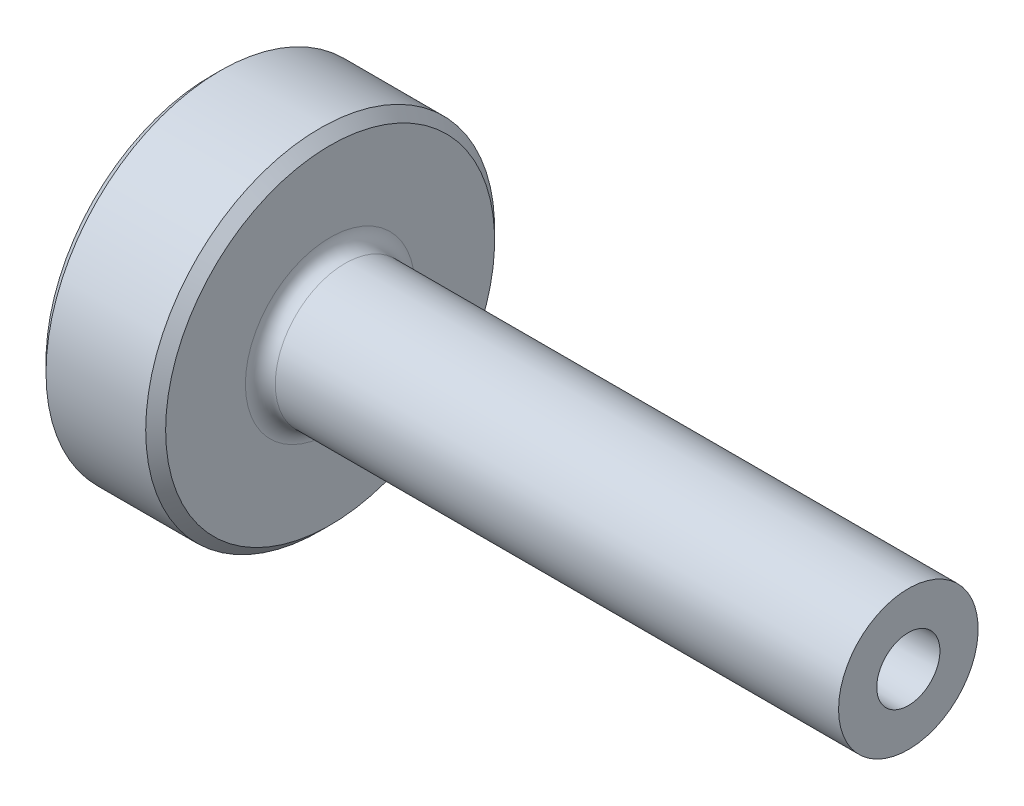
ISO-10303-21;
HEADER;
FILE_DESCRIPTION(('STEP AP214'),'2;1');
FILE_NAME('part.step','',(''),(''),'','','');
FILE_SCHEMA(('AUTOMOTIVE_DESIGN { 1 0 10303 214 1 1 1 1 }'));
ENDSEC;
DATA;
#1=APPLICATION_CONTEXT('core data for automotive mechanical design processes');
#2=APPLICATION_PROTOCOL_DEFINITION('international standard','automotive_design',2000,#1);
#3=PRODUCT_CONTEXT('',#1,'mechanical');
#4=PRODUCT('Part','Part','',(#3));
#5=PRODUCT_RELATED_PRODUCT_CATEGORY('part','',(#4));
#6=PRODUCT_DEFINITION_FORMATION('','',#4);
#7=PRODUCT_DEFINITION_CONTEXT('part definition',#1,'design');
#8=PRODUCT_DEFINITION('design','',#6,#7);
#9=PRODUCT_DEFINITION_SHAPE('','',#8);
#10=(LENGTH_UNIT() NAMED_UNIT(*) SI_UNIT(.MILLI.,.METRE.));
#11=(NAMED_UNIT(*) PLANE_ANGLE_UNIT() SI_UNIT($,.RADIAN.));
#12=(NAMED_UNIT(*) SI_UNIT($,.STERADIAN.) SOLID_ANGLE_UNIT());
#13=UNCERTAINTY_MEASURE_WITH_UNIT(LENGTH_MEASURE(1.E-05),#10,'distance_accuracy_value','');
#14=(GEOMETRIC_REPRESENTATION_CONTEXT(3) GLOBAL_UNCERTAINTY_ASSIGNED_CONTEXT((#13)) GLOBAL_UNIT_ASSIGNED_CONTEXT((#10,
#11,#12)) REPRESENTATION_CONTEXT('',''));
#15=CARTESIAN_POINT('',(0.,0.,0.));
#16=DIRECTION('',(0.,0.,1.));
#17=DIRECTION('',(1.,0.,0.));
#18=AXIS2_PLACEMENT_3D('',#15,#16,#17);
#19=CARTESIAN_POINT('',(0.,0.,0.));
#20=DIRECTION('',(-1.,0.,0.));
#21=DIRECTION('',(0.,0.,1.));
#22=AXIS2_PLACEMENT_3D('',#19,#20,#21);
#23=CYLINDRICAL_SURFACE('',#22,17.5);
#24=CARTESIAN_POINT('',(0.999999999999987,0.,0.));
#25=DIRECTION('',(1.,0.,0.));
#26=DIRECTION('',(0.,0.,-1.));
#27=AXIS2_PLACEMENT_3D('',#24,#25,#26);
#28=CIRCLE('',#27,17.5);
#29=CARTESIAN_POINT('',(0.999999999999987,0.,-17.5));
#30=VERTEX_POINT('',#29);
#31=EDGE_CURVE('E9',#30,#30,#28,.T.);
#32=ORIENTED_EDGE('',*,*,#31,.T.);
#33=EDGE_LOOP('',(#32));
#34=FACE_BOUND('',#33,.T.);
#35=CARTESIAN_POINT('',(11.,0.,0.));
#36=DIRECTION('',(-1.,0.,0.));
#37=DIRECTION('',(0.,0.,1.));
#38=AXIS2_PLACEMENT_3D('',#35,#36,#37);
#39=CIRCLE('',#38,17.5);
#40=CARTESIAN_POINT('',(11.,0.,17.5));
#41=VERTEX_POINT('',#40);
#42=EDGE_CURVE('E29',#41,#41,#39,.T.);
#43=ORIENTED_EDGE('',*,*,#42,.T.);
#44=EDGE_LOOP('',(#43));
#45=FACE_BOUND('',#44,.T.);
#46=ADVANCED_FACE('F14',(#34,#45),#23,.T.);
#47=CARTESIAN_POINT('',(12.,17.5,0.));
#48=DIRECTION('',(-1.,0.,0.));
#49=DIRECTION('',(0.,0.,1.));
#50=AXIS2_PLACEMENT_3D('',#47,#48,#49);
#51=PLANE('',#50);
#52=CARTESIAN_POINT('',(12.,0.,0.));
#53=DIRECTION('',(-1.,0.,0.));
#54=DIRECTION('',(0.,0.,1.));
#55=AXIS2_PLACEMENT_3D('',#52,#53,#54);
#56=CIRCLE('',#55,16.5);
#57=CARTESIAN_POINT('',(12.,0.,16.5));
#58=VERTEX_POINT('',#57);
#59=EDGE_CURVE('E25',#58,#58,#56,.F.);
#60=ORIENTED_EDGE('',*,*,#59,.T.);
#61=EDGE_LOOP('',(#60));
#62=FACE_BOUND('',#61,.T.);
#63=CARTESIAN_POINT('',(12.,0.,0.));
#64=DIRECTION('',(-1.,0.,0.));
#65=DIRECTION('',(0.,0.,1.));
#66=AXIS2_PLACEMENT_3D('',#63,#64,#65);
#67=CIRCLE('',#66,8.5);
#68=CARTESIAN_POINT('',(12.,0.,8.5));
#69=VERTEX_POINT('',#68);
#70=EDGE_CURVE('E34',#69,#69,#67,.T.);
#71=ORIENTED_EDGE('',*,*,#70,.T.);
#72=EDGE_LOOP('',(#71));
#73=FACE_BOUND('',#72,.T.);
#74=ADVANCED_FACE('F70',(#62,#73),#51,.F.);
#75=CARTESIAN_POINT('',(13.5,0.,0.));
#76=DIRECTION('',(-1.,0.,0.));
#77=DIRECTION('',(0.,0.,1.));
#78=AXIS2_PLACEMENT_3D('',#75,#76,#77);
#79=TOROIDAL_SURFACE('',#78,8.5,1.5);
#80=ORIENTED_EDGE('',*,*,#70,.F.);
#81=EDGE_LOOP('',(#80));
#82=FACE_BOUND('',#81,.T.);
#83=CARTESIAN_POINT('',(13.5,0.,0.));
#84=DIRECTION('',(-1.,0.,0.));
#85=DIRECTION('',(0.,0.,1.));
#86=AXIS2_PLACEMENT_3D('',#83,#84,#85);
#87=CIRCLE('',#86,7.);
#88=CARTESIAN_POINT('',(13.5,0.,7.));
#89=VERTEX_POINT('',#88);
#90=EDGE_CURVE('E37',#89,#89,#87,.T.);
#91=ORIENTED_EDGE('',*,*,#90,.T.);
#92=EDGE_LOOP('',(#91));
#93=FACE_BOUND('',#92,.T.);
#94=ADVANCED_FACE('F76',(#82,#93),#79,.F.);
#95=CARTESIAN_POINT('',(0.,0.,0.));
#96=DIRECTION('',(-1.,0.,0.));
#97=DIRECTION('',(0.,0.,1.));
#98=AXIS2_PLACEMENT_3D('',#95,#96,#97);
#99=CYLINDRICAL_SURFACE('',#98,7.);
#100=ORIENTED_EDGE('',*,*,#90,.F.);
#101=EDGE_LOOP('',(#100));
#102=FACE_BOUND('',#101,.T.);
#103=CARTESIAN_POINT('',(70.,0.,0.));
#104=DIRECTION('',(-1.,0.,0.));
#105=DIRECTION('',(0.,0.,1.));
#106=AXIS2_PLACEMENT_3D('',#103,#104,#105);
#107=CIRCLE('',#106,7.);
#108=CARTESIAN_POINT('',(70.,0.,7.));
#109=VERTEX_POINT('',#108);
#110=EDGE_CURVE('E40',#109,#109,#107,.T.);
#111=ORIENTED_EDGE('',*,*,#110,.T.);
#112=EDGE_LOOP('',(#111));
#113=FACE_BOUND('',#112,.T.);
#114=ADVANCED_FACE('F83',(#102,#113),#99,.T.);
#115=CARTESIAN_POINT('',(70.,3.16948935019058,0.));
#116=DIRECTION('',(-1.,0.,0.));
#117=DIRECTION('',(0.,0.,1.));
#118=AXIS2_PLACEMENT_3D('',#115,#116,#117);
#119=PLANE('',#118);
#120=ORIENTED_EDGE('',*,*,#110,.F.);
#121=EDGE_LOOP('',(#120));
#122=FACE_BOUND('',#121,.T.);
#123=CARTESIAN_POINT('',(70.,0.,0.));
#124=DIRECTION('',(-1.,0.,0.));
#125=DIRECTION('',(0.,0.,1.));
#126=AXIS2_PLACEMENT_3D('',#123,#124,#125);
#127=CIRCLE('',#126,3.16948935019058);
#128=CARTESIAN_POINT('',(70.,0.,3.16948935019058));
#129=VERTEX_POINT('',#128);
#130=EDGE_CURVE('E43',#129,#129,#127,.T.);
#131=ORIENTED_EDGE('',*,*,#130,.T.);
#132=EDGE_LOOP('',(#131));
#133=FACE_BOUND('',#132,.T.);
#134=ADVANCED_FACE('F87',(#122,#133),#119,.F.);
#135=CARTESIAN_POINT('',(3.,0.,0.));
#136=DIRECTION('',(1.,0.,0.));
#137=DIRECTION('',(0.,0.,-1.));
#138=AXIS2_PLACEMENT_3D('',#135,#136,#137);
#139=CONICAL_SURFACE('',#138,2.,0.0174532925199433);
#140=ORIENTED_EDGE('',*,*,#130,.F.);
#141=EDGE_LOOP('',(#140));
#142=FACE_BOUND('',#141,.T.);
#143=CARTESIAN_POINT('',(3.,0.,0.));
#144=DIRECTION('',(-1.,0.,0.));
#145=DIRECTION('',(0.,0.,1.));
#146=AXIS2_PLACEMENT_3D('',#143,#144,#145);
#147=CIRCLE('',#146,2.);
#148=CARTESIAN_POINT('',(3.,0.,2.));
#149=VERTEX_POINT('',#148);
#150=EDGE_CURVE('E46',#149,#149,#147,.T.);
#151=ORIENTED_EDGE('',*,*,#150,.T.);
#152=EDGE_LOOP('',(#151));
#153=FACE_BOUND('',#152,.T.);
#154=ADVANCED_FACE('F66',(#142,#153),#139,.F.);
#155=CARTESIAN_POINT('',(-11.7373835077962,0.,0.));
#156=DIRECTION('',(-1.,0.,0.));
#157=DIRECTION('',(0.,0.,1.));
#158=AXIS2_PLACEMENT_3D('',#155,#156,#157);
#159=DEGENERATE_TOROIDAL_SURFACE('',#158,0.794553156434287,15.,.F.);
#160=ORIENTED_EDGE('',*,*,#150,.F.);
#161=EDGE_LOOP('',(#160));
#162=FACE_BOUND('',#161,.T.);
#163=CARTESIAN_POINT('',(0.,0.,0.));
#164=DIRECTION('',(-1.,0.,0.));
#165=DIRECTION('',(0.,0.,1.));
#166=AXIS2_PLACEMENT_3D('',#163,#164,#165);
#167=CIRCLE('',#166,8.54535200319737);
#168=CARTESIAN_POINT('',(0.,0.,8.54535200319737));
#169=VERTEX_POINT('',#168);
#170=EDGE_CURVE('E49',#169,#169,#167,.T.);
#171=ORIENTED_EDGE('',*,*,#170,.T.);
#172=EDGE_LOOP('',(#171));
#173=FACE_BOUND('',#172,.T.);
#174=ADVANCED_FACE('F53',(#162,#173),#159,.T.);
#175=CARTESIAN_POINT('',(0.,8.54535200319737,0.));
#176=DIRECTION('',(1.,0.,0.));
#177=DIRECTION('',(0.,0.,-1.));
#178=AXIS2_PLACEMENT_3D('',#175,#176,#177);
#179=PLANE('',#178);
#180=CARTESIAN_POINT('',(0.,0.,0.));
#181=DIRECTION('',(1.,0.,0.));
#182=DIRECTION('',(0.,0.,-1.));
#183=AXIS2_PLACEMENT_3D('',#180,#181,#182);
#184=CIRCLE('',#183,16.5);
#185=CARTESIAN_POINT('',(0.,0.,-16.5));
#186=VERTEX_POINT('',#185);
#187=EDGE_CURVE('E21',#186,#186,#184,.F.);
#188=ORIENTED_EDGE('',*,*,#187,.T.);
#189=EDGE_LOOP('',(#188));
#190=FACE_BOUND('',#189,.T.);
#191=ORIENTED_EDGE('',*,*,#170,.F.);
#192=EDGE_LOOP('',(#191));
#193=FACE_BOUND('',#192,.T.);
#194=ADVANCED_FACE('F55',(#190,#193),#179,.F.);
#195=CARTESIAN_POINT('',(11.,0.,0.));
#196=DIRECTION('',(-1.,0.,0.));
#197=DIRECTION('',(0.,0.,1.));
#198=AXIS2_PLACEMENT_3D('',#195,#196,#197);
#199=CONICAL_SURFACE('',#198,17.5,0.785398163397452);
#200=ORIENTED_EDGE('',*,*,#59,.F.);
#201=EDGE_LOOP('',(#200));
#202=FACE_BOUND('',#201,.T.);
#203=ORIENTED_EDGE('',*,*,#42,.F.);
#204=EDGE_LOOP('',(#203));
#205=FACE_BOUND('',#204,.T.);
#206=ADVANCED_FACE('F57',(#202,#205),#199,.T.);
#207=CARTESIAN_POINT('',(0.,0.,0.));
#208=DIRECTION('',(1.,0.,0.));
#209=DIRECTION('',(0.,0.,-1.));
#210=AXIS2_PLACEMENT_3D('',#207,#208,#209);
#211=CONICAL_SURFACE('',#210,16.5,0.785398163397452);
#212=ORIENTED_EDGE('',*,*,#31,.F.);
#213=EDGE_LOOP('',(#212));
#214=FACE_BOUND('',#213,.T.);
#215=ORIENTED_EDGE('',*,*,#187,.F.);
#216=EDGE_LOOP('',(#215));
#217=FACE_BOUND('',#216,.T.);
#218=ADVANCED_FACE('F16',(#214,#217),#211,.T.);
#219=CLOSED_SHELL('',(#46,#74,#94,#114,#134,#154,#174,#194,#206,#218));
#220=MANIFOLD_SOLID_BREP('B1',#219);
#221=ADVANCED_BREP_SHAPE_REPRESENTATION('',(#18,#220),#14);
#222=SHAPE_DEFINITION_REPRESENTATION(#9,#221);
ENDSEC;
END-ISO-10303-21;
